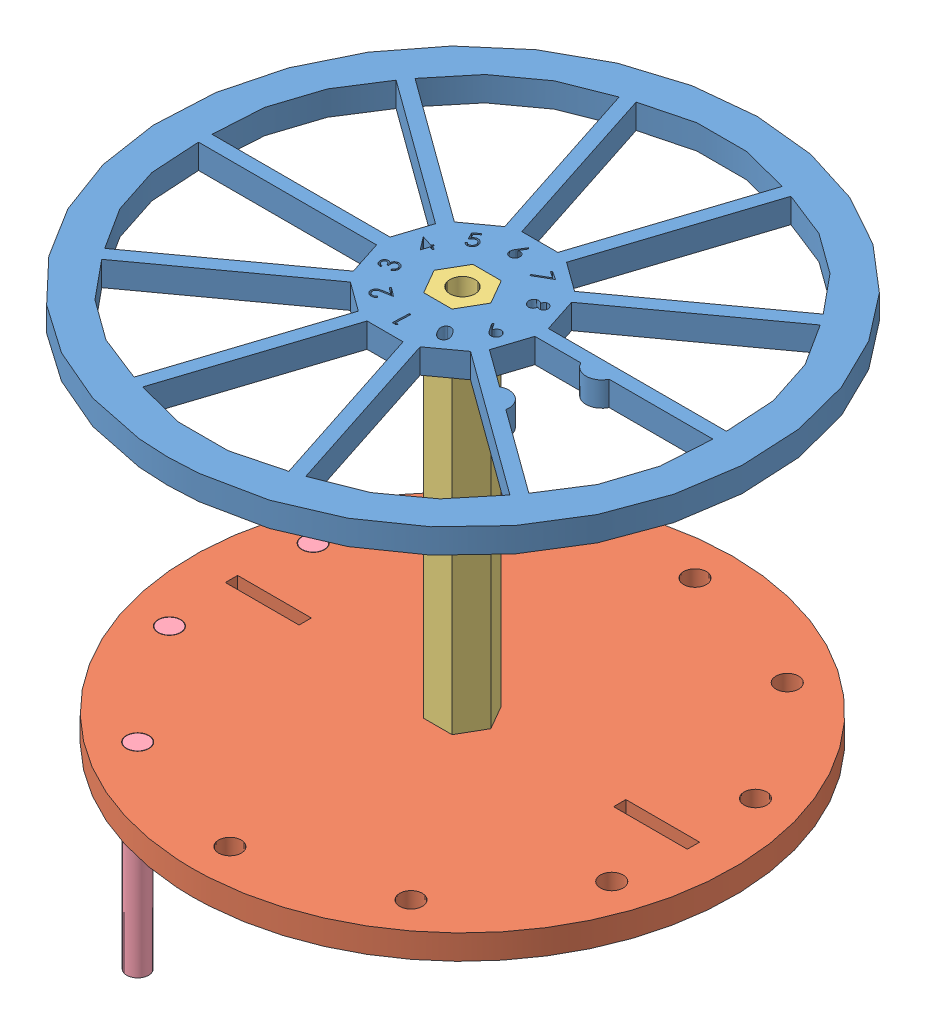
SolidWorks assembly Input.SLDASM, configuration Default (file format 7000). Lengths in mm.
Overall size (76.2 73.03 76.2).
6 component instances, 4 part files, 12 mates.
Components (placement in the parent):
- InputWheel-1: InputWheel.SLDPRT [Default] at (0 -26.1802 0) size (76.2 3.17 76.2)
- AccumulatorGear-1: AccumulatorGear.SLDPRT [input] at (0 -73.8052 0) size (69.85 3.17 69.85)
- Standoff-2in-1s4-1: Standoff-2in-1s4.SLDPRT [Default] at (0 -73.8052 0) size (7.33 50.8 6.35)
- Screw-4-40-1in-1: Screw-4-40-1in.SLDPRT [Default] at (-28.575 -96.0302 9.2846) size (2.84 25.4 2.84)
- Screw-4-40-1in-2: Screw-4-40-1in.SLDPRT [Default] at (-17.6603 -96.0302 24.3073) size (2.84 25.4 2.84)
- Screw-4-40-1in-3: Screw-4-40-1in.SLDPRT [Default] at (-28.575 -96.0302 -9.2846) size (2.84 25.4 2.84)
Mates (geometry in assembly coordinates):
- Coincident1: coincident aligned: plane of InputWheel-1 through (0 -23.0052 0) normal (0 1 0); plane of Standoff-2in-1s4-1 through (0 -23.0052 0) normal (0 1 0)
- Coincident2: coincident anti-aligned: plane of InputWheel-1 through (-1.8331 -23.0052 -3.175) normal (0.866025 0 0.5); plane of Standoff-2in-1s4-1 through (-1.8331 -23.0052 -3.175) normal (-0.866025 0 -0.5)
- Coincident3: coincident anti-aligned: plane of InputWheel-1 through (1.8331 -23.0052 -3.175) normal (0 0 1); plane of Standoff-2in-1s4-1 through (1.8331 -23.0052 -3.175) normal (0 0 -1)
- Coincident4: coincident aligned: plane of AccumulatorGear-1 through (0 -73.8052 0) normal (0 -1 0); plane of Standoff-2in-1s4-1 through (0 -73.8052 0) normal (0 -1 0)
- Coincident5: coincident anti-aligned: plane of AccumulatorGear-1 through (-1.8331 -70.6302 -3.175) normal (0.866025 0 0.5); plane of Standoff-2in-1s4-1 through (-1.8331 -23.0052 -3.175) normal (-0.866025 0 -0.5)
- Coincident6: coincident anti-aligned: plane of AccumulatorGear-1 through (1.8331 -70.6302 -3.175) normal (0 0 1); plane of Standoff-2in-1s4-1 through (1.8331 -23.0052 -3.175) normal (0 0 -1)
- Concentric1: concentric aligned: circle of AccumulatorGear-1; circle of Screw-4-40-1in-1
- Coincident7: coincident aligned: plane of AccumulatorGear-1 through (0 -70.6302 0) normal (0 1 0); plane of Screw-4-40-1in-1 through (-28.575 -70.6302 9.2846) normal (0 1 0)
- Concentric2: concentric aligned: circle of AccumulatorGear-1; circle of Screw-4-40-1in-2
- Coincident8: coincident aligned: plane of AccumulatorGear-1 through (0 -70.6302 0) normal (0 1 0); plane of Screw-4-40-1in-2 through (-17.6603 -70.6302 24.3073) normal (0 1 0)
- Concentric3: concentric aligned: circle of AccumulatorGear-1; circle of Screw-4-40-1in-3
- Coincident9: coincident aligned: plane of AccumulatorGear-1 through (0 -70.6302 0) normal (0 1 0); plane of Screw-4-40-1in-3 through (-28.575 -70.6302 -9.2846) normal (0 1 0)
